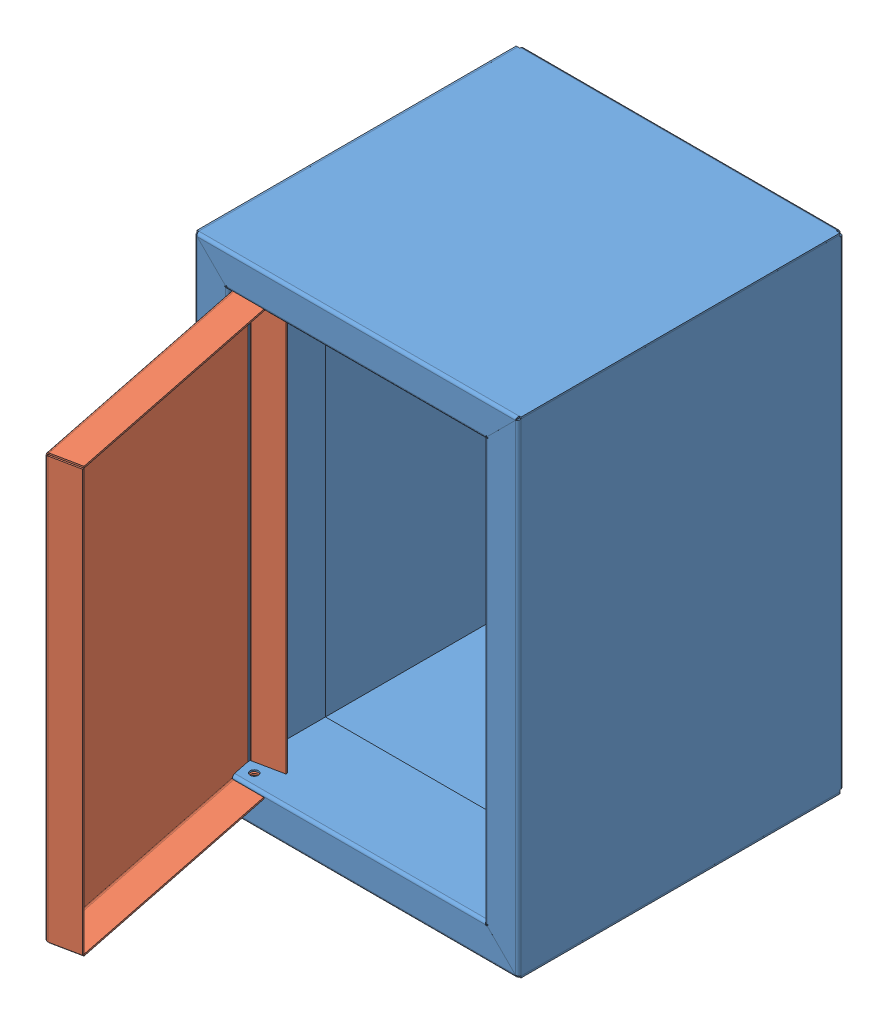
SolidWorks assembly 电控柜.SLDASM, configuration 默认 (file format 4400). Lengths in mm.
Overall size (200 300 345.49).
2 component instances, 2 part files, 2 mates.
Components (placement in the parent):
- 电控柜零件一-1: 电控柜零件一.SLDPRT [默认] at (-80.3493 2.641 -100.5) size (200 300 201)
- 电控柜零件二-1: 电控柜零件二.SLDPRT [默认] at (-143.6108 1.641 165.4255) x (-0.19995 0 -0.979806) z (0.979806 0 -0.19995) size (162 262 20)
Mates (geometry in assembly coordinates):
- 同心1: concentric anti-aligned: cylinder of 电控柜零件一-1 through (-151.3486 128.641 92.5) axis (0 -1 0) radius 2.5; cylinder of 电控柜零件二-1 through (-151.3486 -129.359 92.5) axis (0 1 0) radius 2.5
- 距离1: distance = 20 mm aligned: plane of 电控柜零件二-1 through (-127.6148 132.641 243.81) normal (0 1 0); plane of 电控柜零件一-1 through (-180.3493 152.641 99.5) normal (0 1 0)
